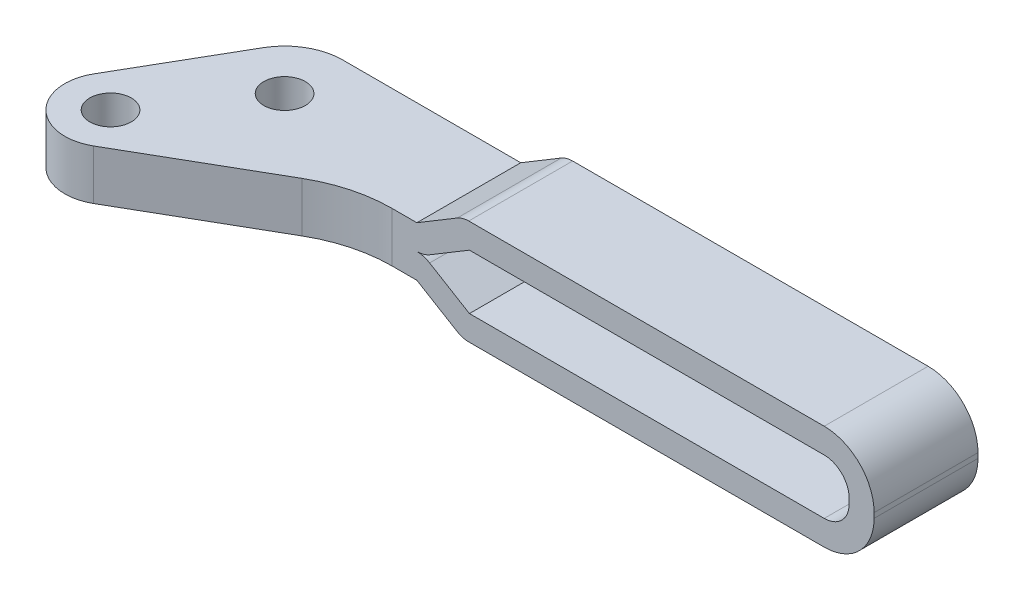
ISO-10303-21;
HEADER;
FILE_DESCRIPTION(('STEP AP214'),'2;1');
FILE_NAME('part.step','',(''),(''),'','','');
FILE_SCHEMA(('AUTOMOTIVE_DESIGN { 1 0 10303 214 1 1 1 1 }'));
ENDSEC;
DATA;
#1=APPLICATION_CONTEXT('core data for automotive mechanical design processes');
#2=APPLICATION_PROTOCOL_DEFINITION('international standard','automotive_design',2000,#1);
#3=PRODUCT_CONTEXT('',#1,'mechanical');
#4=PRODUCT('Part','Part','',(#3));
#5=PRODUCT_RELATED_PRODUCT_CATEGORY('part','',(#4));
#6=PRODUCT_DEFINITION_FORMATION('','',#4);
#7=PRODUCT_DEFINITION_CONTEXT('part definition',#1,'design');
#8=PRODUCT_DEFINITION('design','',#6,#7);
#9=PRODUCT_DEFINITION_SHAPE('','',#8);
#10=(LENGTH_UNIT() NAMED_UNIT(*) SI_UNIT(.MILLI.,.METRE.));
#11=(NAMED_UNIT(*) PLANE_ANGLE_UNIT() SI_UNIT($,.RADIAN.));
#12=(NAMED_UNIT(*) SI_UNIT($,.STERADIAN.) SOLID_ANGLE_UNIT());
#13=UNCERTAINTY_MEASURE_WITH_UNIT(LENGTH_MEASURE(1.E-05),#10,'distance_accuracy_value','');
#14=(GEOMETRIC_REPRESENTATION_CONTEXT(3) GLOBAL_UNCERTAINTY_ASSIGNED_CONTEXT((#13)) GLOBAL_UNIT_ASSIGNED_CONTEXT((#10,
#11,#12)) REPRESENTATION_CONTEXT('',''));
#15=CARTESIAN_POINT('',(0.,0.,0.));
#16=DIRECTION('',(0.,0.,1.));
#17=DIRECTION('',(1.,0.,0.));
#18=AXIS2_PLACEMENT_3D('',#15,#16,#17);
#19=CARTESIAN_POINT('',(30.1762943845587,3.00279999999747,-74.1617743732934));
#20=DIRECTION('',(0.,0.,1.));
#21=DIRECTION('',(1.,0.,0.));
#22=AXIS2_PLACEMENT_3D('',#19,#20,#21);
#23=CYLINDRICAL_SURFACE('',#22,3.);
#24=CARTESIAN_POINT('',(30.1762943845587,3.00279999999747,-6.67526594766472));
#25=DIRECTION('',(0.,0.,1.));
#26=DIRECTION('',(1.,0.,0.));
#27=AXIS2_PLACEMENT_3D('',#24,#25,#26);
#28=CIRCLE('',#27,3.);
#29=CARTESIAN_POINT('',(31.7214086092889,0.431298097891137,-6.67526594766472));
#30=VERTEX_POINT('',#29);
#31=CARTESIAN_POINT('',(30.1716344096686,0.00279819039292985,-6.67526594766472));
#32=VERTEX_POINT('',#31);
#33=EDGE_CURVE('E76',#30,#32,#28,.F.);
#34=ORIENTED_EDGE('',*,*,#33,.T.);
#35=DIRECTION('',(0.,0.,1.));
#36=VECTOR('',#35,1.);
#37=CARTESIAN_POINT('',(30.1716344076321,0.00280361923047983,-12.9252659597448));
#38=LINE('',#37,#36);
#39=CARTESIAN_POINT('',(30.1716344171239,0.00279712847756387,-19.1752659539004));
#40=VERTEX_POINT('',#39);
#41=EDGE_CURVE('E277',#40,#32,#38,.T.);
#42=ORIENTED_EDGE('',*,*,#41,.F.);
#43=CARTESIAN_POINT('',(30.1762943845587,3.00279999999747,-19.1752659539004));
#44=DIRECTION('',(0.,0.,1.));
#45=DIRECTION('',(1.,0.,0.));
#46=AXIS2_PLACEMENT_3D('',#43,#44,#45);
#47=CIRCLE('',#46,3.);
#48=CARTESIAN_POINT('',(31.7214086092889,0.431298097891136,-19.1752659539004));
#49=VERTEX_POINT('',#48);
#50=EDGE_CURVE('E69',#40,#49,#47,.T.);
#51=ORIENTED_EDGE('',*,*,#50,.T.);
#52=DIRECTION('',(0.,0.,1.));
#53=VECTOR('',#52,1.);
#54=CARTESIAN_POINT('',(31.7214086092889,0.431298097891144,-74.1617743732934));
#55=LINE('',#54,#53);
#56=EDGE_CURVE('E295',#49,#30,#55,.T.);
#57=ORIENTED_EDGE('',*,*,#56,.T.);
#58=EDGE_LOOP('',(#34,#42,#51,#57));
#59=FACE_BOUND('',#58,.T.);
#60=ADVANCED_FACE('F14',(#59),#23,.T.);
#61=CARTESIAN_POINT('',(87.8038285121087,6.59999999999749,-6.6752659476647));
#62=DIRECTION('',(0.,0.,1.));
#63=DIRECTION('',(0.,-1.,0.));
#64=AXIS2_PLACEMENT_3D('',#61,#62,#63);
#65=PLANE('',#64);
#66=DIRECTION('',(-0.857167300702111,0.515038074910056,0.));
#67=VECTOR('',#66,1.);
#68=CARTESIAN_POINT('',(36.500390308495,-3.30280000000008,-6.67526594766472));
#69=LINE('',#68,#67);
#70=CARTESIAN_POINT('',(36.500390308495,-3.30280000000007,-6.67526594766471));
#71=VERTEX_POINT('',#70);
#72=CARTESIAN_POINT('',(31.7120886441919,-0.425698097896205,-6.67526594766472));
#73=VERTEX_POINT('',#72);
#74=EDGE_CURVE('E82',#71,#73,#69,.T.);
#75=ORIENTED_EDGE('',*,*,#74,.T.);
#76=CARTESIAN_POINT('',(30.1669744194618,-2.99720000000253,-6.67526594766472));
#77=DIRECTION('',(0.,0.,1.));
#78=DIRECTION('',(1.,0.,0.));
#79=AXIS2_PLACEMENT_3D('',#76,#77,#78);
#80=CIRCLE('',#79,3.);
#81=EDGE_CURVE('E300',#32,#73,#80,.F.);
#82=ORIENTED_EDGE('',*,*,#81,.F.);
#83=ORIENTED_EDGE('',*,*,#33,.F.);
#84=DIRECTION('',(0.857167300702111,0.515038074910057,0.));
#85=VECTOR('',#84,1.);
#86=CARTESIAN_POINT('',(31.7214086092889,0.431298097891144,-6.67526594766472));
#87=LINE('',#86,#85);
#88=CARTESIAN_POINT('',(36.5003903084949,3.30279999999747,-6.67526594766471));
#89=VERTEX_POINT('',#88);
#90=EDGE_CURVE('E467',#30,#89,#87,.T.);
#91=ORIENTED_EDGE('',*,*,#90,.T.);
#92=DIRECTION('',(1.,0.,0.));
#93=VECTOR('',#92,1.);
#94=CARTESIAN_POINT('',(87.8038285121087,3.30279999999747,-6.6752659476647));
#95=LINE('',#94,#93);
#96=CARTESIAN_POINT('',(79.1812007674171,3.30279999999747,-6.67526594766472));
#97=VERTEX_POINT('',#96);
#98=EDGE_CURVE('E464',#89,#97,#95,.T.);
#99=ORIENTED_EDGE('',*,*,#98,.T.);
#100=CARTESIAN_POINT('',(79.1812007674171,0.302799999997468,-6.67526594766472));
#101=DIRECTION('',(0.,0.,1.));
#102=DIRECTION('',(1.,0.,0.));
#103=AXIS2_PLACEMENT_3D('',#100,#101,#102);
#104=CIRCLE('',#103,3.);
#105=CARTESIAN_POINT('',(82.1812007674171,0.302799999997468,-6.67526594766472));
#106=VERTEX_POINT('',#105);
#107=EDGE_CURVE('E466',#97,#106,#104,.F.);
#108=ORIENTED_EDGE('',*,*,#107,.T.);
#109=DIRECTION('',(0.,-1.,0.));
#110=VECTOR('',#109,1.);
#111=CARTESIAN_POINT('',(82.1812007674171,6.59999999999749,-6.6752659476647));
#112=LINE('',#111,#110);
#113=CARTESIAN_POINT('',(82.1812007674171,-0.302800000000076,-6.67526594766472));
#114=VERTEX_POINT('',#113);
#115=EDGE_CURVE('E469',#106,#114,#112,.T.);
#116=ORIENTED_EDGE('',*,*,#115,.T.);
#117=CARTESIAN_POINT('',(79.1812007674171,-0.302800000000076,-6.67526594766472));
#118=DIRECTION('',(0.,0.,1.));
#119=DIRECTION('',(1.,0.,0.));
#120=AXIS2_PLACEMENT_3D('',#117,#118,#119);
#121=CIRCLE('',#120,3.);
#122=CARTESIAN_POINT('',(79.1812007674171,-3.30280000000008,-6.67526594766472));
#123=VERTEX_POINT('',#122);
#124=EDGE_CURVE('E475',#114,#123,#121,.F.);
#125=ORIENTED_EDGE('',*,*,#124,.T.);
#126=DIRECTION('',(1.,0.,0.));
#127=VECTOR('',#126,1.);
#128=CARTESIAN_POINT('',(87.8038285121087,-3.30280000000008,-6.67526594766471));
#129=LINE('',#128,#127);
#130=EDGE_CURVE('E477',#123,#71,#129,.F.);
#131=ORIENTED_EDGE('',*,*,#130,.T.);
#132=EDGE_LOOP('',(#75,#82,#83,#91,#99,#108,#116,#125,#131));
#133=FACE_BOUND('',#132,.T.);
#134=DIRECTION('',(1.,0.,0.));
#135=VECTOR('',#134,1.);
#136=CARTESIAN_POINT('',(87.8038285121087,2.99999999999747,-6.67526594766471));
#137=LINE('',#136,#135);
#138=CARTESIAN_POINT('',(30.177070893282,2.99999999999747,-6.67526594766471));
#139=VERTEX_POINT('',#138);
#140=CARTESIAN_POINT('',(27.1893006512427,2.99999999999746,-6.67526594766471));
#141=VERTEX_POINT('',#140);
#142=EDGE_CURVE('E479',#139,#141,#137,.F.);
#143=ORIENTED_EDGE('',*,*,#142,.T.);
#144=DIRECTION('',(0.,-1.,0.));
#145=VECTOR('',#144,1.);
#146=CARTESIAN_POINT('',(27.1893006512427,6.59999999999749,-6.67526594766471));
#147=LINE('',#146,#145);
#148=CARTESIAN_POINT('',(27.1893006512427,-3.00000000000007,-6.67526594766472));
#149=VERTEX_POINT('',#148);
#150=EDGE_CURVE('E481',#141,#149,#147,.T.);
#151=ORIENTED_EDGE('',*,*,#150,.T.);
#152=DIRECTION('',(1.,0.,0.));
#153=VECTOR('',#152,1.);
#154=CARTESIAN_POINT('',(87.8038285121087,-3.00000000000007,-6.67526594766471));
#155=LINE('',#154,#153);
#156=CARTESIAN_POINT('',(30.1770708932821,-3.00000000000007,-6.67526594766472));
#157=VERTEX_POINT('',#156);
#158=EDGE_CURVE('E483',#149,#157,#155,.T.);
#159=ORIENTED_EDGE('',*,*,#158,.T.);
#160=DIRECTION('',(0.857167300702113,-0.515038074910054,0.));
#161=VECTOR('',#160,1.);
#162=CARTESIAN_POINT('',(30.1770708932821,-3.00000000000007,-6.67526594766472));
#163=LINE('',#162,#161);
#164=CARTESIAN_POINT('',(35.0280322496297,-5.91475164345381,-6.67526594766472));
#165=VERTEX_POINT('',#164);
#166=EDGE_CURVE('E446',#157,#165,#163,.T.);
#167=ORIENTED_EDGE('',*,*,#166,.T.);
#168=CARTESIAN_POINT('',(36.4171929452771,-3.60280000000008,-6.67526594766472));
#169=DIRECTION('',(0.,0.,1.));
#170=DIRECTION('',(1.,0.,0.));
#171=AXIS2_PLACEMENT_3D('',#168,#169,#170);
#172=CIRCLE('',#171,2.6972);
#173=CARTESIAN_POINT('',(36.4171929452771,-6.30000000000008,-6.67526594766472));
#174=VERTEX_POINT('',#173);
#175=EDGE_CURVE('E443',#165,#174,#172,.T.);
#176=ORIENTED_EDGE('',*,*,#175,.T.);
#177=DIRECTION('',(1.,0.,0.));
#178=VECTOR('',#177,1.);
#179=CARTESIAN_POINT('',(87.8038285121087,-6.30000000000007,-6.67526594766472));
#180=LINE('',#179,#178);
#181=CARTESIAN_POINT('',(79.1812007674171,-6.30000000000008,-6.67526594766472));
#182=VERTEX_POINT('',#181);
#183=EDGE_CURVE('E441',#174,#182,#180,.T.);
#184=ORIENTED_EDGE('',*,*,#183,.T.);
#185=CARTESIAN_POINT('',(79.1812007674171,-0.30000000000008,-6.67526594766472));
#186=DIRECTION('',(0.,0.,1.));
#187=DIRECTION('',(1.,0.,0.));
#188=AXIS2_PLACEMENT_3D('',#185,#186,#187);
#189=CIRCLE('',#188,6.);
#190=CARTESIAN_POINT('',(85.1812007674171,-0.30000000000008,-6.67526594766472));
#191=VERTEX_POINT('',#190);
#192=EDGE_CURVE('E429',#191,#182,#189,.F.);
#193=ORIENTED_EDGE('',*,*,#192,.F.);
#194=DIRECTION('',(0.,-1.,0.));
#195=VECTOR('',#194,1.);
#196=CARTESIAN_POINT('',(85.1812007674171,6.59999999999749,-6.6752659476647));
#197=LINE('',#196,#195);
#198=CARTESIAN_POINT('',(85.1812007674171,0.299999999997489,-6.67526594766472));
#199=VERTEX_POINT('',#198);
#200=EDGE_CURVE('E425',#191,#199,#197,.F.);
#201=ORIENTED_EDGE('',*,*,#200,.T.);
#202=CARTESIAN_POINT('',(79.1812007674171,0.299999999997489,-6.67526594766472));
#203=DIRECTION('',(0.,0.,1.));
#204=DIRECTION('',(1.,0.,0.));
#205=AXIS2_PLACEMENT_3D('',#202,#203,#204);
#206=CIRCLE('',#205,6.);
#207=CARTESIAN_POINT('',(79.1812007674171,6.29999999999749,-6.67526594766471));
#208=VERTEX_POINT('',#207);
#209=EDGE_CURVE('E418',#199,#208,#206,.T.);
#210=ORIENTED_EDGE('',*,*,#209,.T.);
#211=DIRECTION('',(1.,0.,0.));
#212=VECTOR('',#211,1.);
#213=CARTESIAN_POINT('',(87.8038285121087,6.29999999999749,-6.6752659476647));
#214=LINE('',#213,#212);
#215=CARTESIAN_POINT('',(36.4171929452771,6.29999999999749,-6.67526594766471));
#216=VERTEX_POINT('',#215);
#217=EDGE_CURVE('E293',#208,#216,#214,.F.);
#218=ORIENTED_EDGE('',*,*,#217,.T.);
#219=CARTESIAN_POINT('',(36.4171929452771,3.60279999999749,-6.67526594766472));
#220=DIRECTION('',(0.,0.,1.));
#221=DIRECTION('',(1.,0.,0.));
#222=AXIS2_PLACEMENT_3D('',#219,#220,#221);
#223=CIRCLE('',#222,2.6972);
#224=CARTESIAN_POINT('',(35.0280322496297,5.91475164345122,-6.67526594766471));
#225=VERTEX_POINT('',#224);
#226=EDGE_CURVE('E289',#225,#216,#223,.F.);
#227=ORIENTED_EDGE('',*,*,#226,.F.);
#228=DIRECTION('',(-0.857167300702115,-0.51503807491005,0.));
#229=VECTOR('',#228,1.);
#230=CARTESIAN_POINT('',(35.0280322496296,5.9147516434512,-6.67526594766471));
#231=LINE('',#230,#229);
#232=EDGE_CURVE('E292',#225,#139,#231,.T.);
#233=ORIENTED_EDGE('',*,*,#232,.T.);
#234=EDGE_LOOP('',(#143,#151,#159,#167,#176,#184,#193,#201,#210,#218,#227,#233));
#235=FACE_BOUND('',#234,.T.);
#236=ADVANCED_FACE('F485',(#133,#235),#65,.T.);
#237=CARTESIAN_POINT('',(30.1669744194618,-2.99720000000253,-74.1617743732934));
#238=DIRECTION('',(0.,0.,1.));
#239=DIRECTION('',(1.,0.,0.));
#240=AXIS2_PLACEMENT_3D('',#237,#238,#239);
#241=CYLINDRICAL_SURFACE('',#240,3.);
#242=ORIENTED_EDGE('',*,*,#81,.T.);
#243=DIRECTION('',(0.,0.,1.));
#244=VECTOR('',#243,1.);
#245=CARTESIAN_POINT('',(31.7120886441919,-0.425698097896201,-74.1617743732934));
#246=LINE('',#245,#244);
#247=CARTESIAN_POINT('',(31.7120886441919,-0.425698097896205,-19.1752659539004));
#248=VERTEX_POINT('',#247);
#249=EDGE_CURVE('E286',#73,#248,#246,.F.);
#250=ORIENTED_EDGE('',*,*,#249,.T.);
#251=CARTESIAN_POINT('',(30.1669744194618,-2.99720000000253,-19.1752659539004));
#252=DIRECTION('',(0.,0.,1.));
#253=DIRECTION('',(1.,0.,0.));
#254=AXIS2_PLACEMENT_3D('',#251,#252,#253);
#255=CIRCLE('',#254,3.);
#256=EDGE_CURVE('E281',#248,#40,#255,.T.);
#257=ORIENTED_EDGE('',*,*,#256,.T.);
#258=ORIENTED_EDGE('',*,*,#41,.T.);
#259=EDGE_LOOP('',(#242,#250,#257,#258));
#260=FACE_BOUND('',#259,.T.);
#261=ADVANCED_FACE('F299',(#260),#241,.T.);
#262=CARTESIAN_POINT('',(7.8038285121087,6.59999999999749,-19.1752659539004));
#263=DIRECTION('',(0.,0.,-1.));
#264=DIRECTION('',(0.,1.,0.));
#265=AXIS2_PLACEMENT_3D('',#262,#263,#264);
#266=PLANE('',#265);
#267=CARTESIAN_POINT('',(79.1812007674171,0.302799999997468,-19.1752659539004));
#268=DIRECTION('',(0.,0.,1.));
#269=DIRECTION('',(1.,0.,0.));
#270=AXIS2_PLACEMENT_3D('',#267,#268,#269);
#271=CIRCLE('',#270,3.);
#272=CARTESIAN_POINT('',(82.1812007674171,0.302799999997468,-19.1752659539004));
#273=VERTEX_POINT('',#272);
#274=CARTESIAN_POINT('',(79.1812007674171,3.30279999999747,-19.1752659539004));
#275=VERTEX_POINT('',#274);
#276=EDGE_CURVE('E280',#273,#275,#271,.T.);
#277=ORIENTED_EDGE('',*,*,#276,.T.);
#278=DIRECTION('',(1.,0.,0.));
#279=VECTOR('',#278,1.);
#280=CARTESIAN_POINT('',(7.8038285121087,3.30279999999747,-19.1752659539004));
#281=LINE('',#280,#279);
#282=CARTESIAN_POINT('',(36.5003903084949,3.30279999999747,-19.1752659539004));
#283=VERTEX_POINT('',#282);
#284=EDGE_CURVE('E320',#275,#283,#281,.F.);
#285=ORIENTED_EDGE('',*,*,#284,.T.);
#286=DIRECTION('',(-0.857167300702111,-0.515038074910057,0.));
#287=VECTOR('',#286,1.);
#288=CARTESIAN_POINT('',(36.5003903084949,3.30279999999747,-19.1752659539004));
#289=LINE('',#288,#287);
#290=EDGE_CURVE('E316',#283,#49,#289,.T.);
#291=ORIENTED_EDGE('',*,*,#290,.T.);
#292=ORIENTED_EDGE('',*,*,#50,.F.);
#293=ORIENTED_EDGE('',*,*,#256,.F.);
#294=DIRECTION('',(0.857167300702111,-0.515038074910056,0.));
#295=VECTOR('',#294,1.);
#296=CARTESIAN_POINT('',(31.7120886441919,-0.425698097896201,-19.1752659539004));
#297=LINE('',#296,#295);
#298=CARTESIAN_POINT('',(36.500390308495,-3.30280000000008,-19.1752659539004));
#299=VERTEX_POINT('',#298);
#300=EDGE_CURVE('E307',#248,#299,#297,.T.);
#301=ORIENTED_EDGE('',*,*,#300,.T.);
#302=DIRECTION('',(1.,0.,0.));
#303=VECTOR('',#302,1.);
#304=CARTESIAN_POINT('',(7.8038285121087,-3.30280000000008,-19.1752659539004));
#305=LINE('',#304,#303);
#306=CARTESIAN_POINT('',(79.1812007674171,-3.30280000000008,-19.1752659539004));
#307=VERTEX_POINT('',#306);
#308=EDGE_CURVE('E315',#299,#307,#305,.T.);
#309=ORIENTED_EDGE('',*,*,#308,.T.);
#310=CARTESIAN_POINT('',(79.1812007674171,-0.302800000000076,-19.1752659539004));
#311=DIRECTION('',(0.,0.,1.));
#312=DIRECTION('',(1.,0.,0.));
#313=AXIS2_PLACEMENT_3D('',#310,#311,#312);
#314=CIRCLE('',#313,3.);
#315=CARTESIAN_POINT('',(82.1812007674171,-0.302800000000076,-19.1752659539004));
#316=VERTEX_POINT('',#315);
#317=EDGE_CURVE('E318',#307,#316,#314,.T.);
#318=ORIENTED_EDGE('',*,*,#317,.T.);
#319=DIRECTION('',(0.,1.,0.));
#320=VECTOR('',#319,1.);
#321=CARTESIAN_POINT('',(82.1812007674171,6.59999999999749,-19.1752659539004));
#322=LINE('',#321,#320);
#323=EDGE_CURVE('E325',#316,#273,#322,.T.);
#324=ORIENTED_EDGE('',*,*,#323,.T.);
#325=EDGE_LOOP('',(#277,#285,#291,#292,#293,#301,#309,#318,#324));
#326=FACE_BOUND('',#325,.T.);
#327=DIRECTION('',(1.,0.,0.));
#328=VECTOR('',#327,1.);
#329=CARTESIAN_POINT('',(7.8038285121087,-6.30000000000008,-19.1752659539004));
#330=LINE('',#329,#328);
#331=CARTESIAN_POINT('',(79.1812007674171,-6.30000000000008,-19.1752659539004));
#332=VERTEX_POINT('',#331);
#333=CARTESIAN_POINT('',(36.4171929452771,-6.30000000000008,-19.1752659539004));
#334=VERTEX_POINT('',#333);
#335=EDGE_CURVE('E328',#332,#334,#330,.F.);
#336=ORIENTED_EDGE('',*,*,#335,.T.);
#337=CARTESIAN_POINT('',(36.4171929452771,-3.60280000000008,-19.1752659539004));
#338=DIRECTION('',(0.,0.,1.));
#339=DIRECTION('',(1.,0.,0.));
#340=AXIS2_PLACEMENT_3D('',#337,#338,#339);
#341=CIRCLE('',#340,2.6972);
#342=CARTESIAN_POINT('',(35.0280322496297,-5.91475164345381,-19.1752659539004));
#343=VERTEX_POINT('',#342);
#344=EDGE_CURVE('E330',#334,#343,#341,.F.);
#345=ORIENTED_EDGE('',*,*,#344,.T.);
#346=DIRECTION('',(-0.857167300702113,0.515038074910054,0.));
#347=VECTOR('',#346,1.);
#348=CARTESIAN_POINT('',(35.0280322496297,-5.9147516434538,-19.1752659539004));
#349=LINE('',#348,#347);
#350=CARTESIAN_POINT('',(30.1770708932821,-3.00000000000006,-19.1752659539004));
#351=VERTEX_POINT('',#350);
#352=EDGE_CURVE('E332',#343,#351,#349,.T.);
#353=ORIENTED_EDGE('',*,*,#352,.T.);
#354=DIRECTION('',(1.,0.,0.));
#355=VECTOR('',#354,1.);
#356=CARTESIAN_POINT('',(7.8038285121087,-3.00000000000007,-19.1752659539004));
#357=LINE('',#356,#355);
#358=CARTESIAN_POINT('',(8.76144388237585,-3.00000000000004,-19.1752659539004));
#359=VERTEX_POINT('',#358);
#360=EDGE_CURVE('E334',#351,#359,#357,.F.);
#361=ORIENTED_EDGE('',*,*,#360,.T.);
#362=DIRECTION('',(0.,1.,0.));
#363=VECTOR('',#362,1.);
#364=CARTESIAN_POINT('',(8.7614438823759,6.59999999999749,-19.1752659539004));
#365=LINE('',#364,#363);
#366=CARTESIAN_POINT('',(8.76144388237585,2.99999999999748,-19.1752659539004));
#367=VERTEX_POINT('',#366);
#368=EDGE_CURVE('E336',#359,#367,#365,.T.);
#369=ORIENTED_EDGE('',*,*,#368,.T.);
#370=DIRECTION('',(1.,0.,0.));
#371=VECTOR('',#370,1.);
#372=CARTESIAN_POINT('',(7.8038285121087,2.99999999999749,-19.1752659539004));
#373=LINE('',#372,#371);
#374=CARTESIAN_POINT('',(30.177070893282,2.99999999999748,-19.1752659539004));
#375=VERTEX_POINT('',#374);
#376=EDGE_CURVE('E338',#367,#375,#373,.T.);
#377=ORIENTED_EDGE('',*,*,#376,.T.);
#378=DIRECTION('',(0.857167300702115,0.51503807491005,0.));
#379=VECTOR('',#378,1.);
#380=CARTESIAN_POINT('',(30.177070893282,2.99999999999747,-19.1752659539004));
#381=LINE('',#380,#379);
#382=CARTESIAN_POINT('',(35.0280322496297,5.91475164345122,-19.1752659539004));
#383=VERTEX_POINT('',#382);
#384=EDGE_CURVE('E276',#375,#383,#381,.T.);
#385=ORIENTED_EDGE('',*,*,#384,.T.);
#386=CARTESIAN_POINT('',(36.4171929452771,3.60279999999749,-19.1752659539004));
#387=DIRECTION('',(0.,0.,1.));
#388=DIRECTION('',(1.,0.,0.));
#389=AXIS2_PLACEMENT_3D('',#386,#387,#388);
#390=CIRCLE('',#389,2.6972);
#391=CARTESIAN_POINT('',(36.4171929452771,6.29999999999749,-19.1752659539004));
#392=VERTEX_POINT('',#391);
#393=EDGE_CURVE('E272',#392,#383,#390,.T.);
#394=ORIENTED_EDGE('',*,*,#393,.F.);
#395=DIRECTION('',(1.,0.,0.));
#396=VECTOR('',#395,1.);
#397=CARTESIAN_POINT('',(7.8038285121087,6.29999999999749,-19.1752659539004));
#398=LINE('',#397,#396);
#399=CARTESIAN_POINT('',(79.1812007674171,6.29999999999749,-19.1752659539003));
#400=VERTEX_POINT('',#399);
#401=EDGE_CURVE('E275',#392,#400,#398,.T.);
#402=ORIENTED_EDGE('',*,*,#401,.T.);
#403=CARTESIAN_POINT('',(79.1812007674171,0.299999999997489,-19.1752659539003));
#404=DIRECTION('',(0.,0.,1.));
#405=DIRECTION('',(1.,0.,0.));
#406=AXIS2_PLACEMENT_3D('',#403,#404,#405);
#407=CIRCLE('',#406,6.);
#408=CARTESIAN_POINT('',(85.1812007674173,0.299999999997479,-19.1752659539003));
#409=VERTEX_POINT('',#408);
#410=EDGE_CURVE('E342',#400,#409,#407,.F.);
#411=ORIENTED_EDGE('',*,*,#410,.T.);
#412=DIRECTION('',(0.,1.,0.));
#413=VECTOR('',#412,1.);
#414=CARTESIAN_POINT('',(85.1812007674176,61.0509586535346,-19.1752659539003));
#415=LINE('',#414,#413);
#416=CARTESIAN_POINT('',(85.1812007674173,-0.30000000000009,-19.1752659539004));
#417=VERTEX_POINT('',#416);
#418=EDGE_CURVE('E344',#417,#409,#415,.T.);
#419=ORIENTED_EDGE('',*,*,#418,.F.);
#420=CARTESIAN_POINT('',(79.1812007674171,-0.30000000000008,-19.1752659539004));
#421=DIRECTION('',(0.,0.,1.));
#422=DIRECTION('',(1.,0.,0.));
#423=AXIS2_PLACEMENT_3D('',#420,#421,#422);
#424=CIRCLE('',#423,6.);
#425=EDGE_CURVE('E347',#417,#332,#424,.F.);
#426=ORIENTED_EDGE('',*,*,#425,.T.);
#427=EDGE_LOOP('',(#336,#345,#353,#361,#369,#377,#385,#394,#402,#411,#419,#426));
#428=FACE_BOUND('',#427,.T.);
#429=ADVANCED_FACE('F305',(#326,#428),#266,.T.);
#430=CARTESIAN_POINT('',(36.5003903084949,3.30279999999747,-74.1617743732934));
#431=DIRECTION('',(-0.515038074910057,0.857167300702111,0.));
#432=DIRECTION('',(-0.857167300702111,-0.515038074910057,0.));
#433=AXIS2_PLACEMENT_3D('',#430,#431,#432);
#434=PLANE('',#433);
#435=DIRECTION('',(0.,0.,1.));
#436=VECTOR('',#435,1.);
#437=CARTESIAN_POINT('',(36.5003903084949,3.30279999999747,-74.1617743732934));
#438=LINE('',#437,#436);
#439=EDGE_CURVE('E350',#283,#89,#438,.T.);
#440=ORIENTED_EDGE('',*,*,#439,.T.);
#441=ORIENTED_EDGE('',*,*,#90,.F.);
#442=ORIENTED_EDGE('',*,*,#56,.F.);
#443=ORIENTED_EDGE('',*,*,#290,.F.);
#444=EDGE_LOOP('',(#440,#441,#442,#443));
#445=FACE_BOUND('',#444,.T.);
#446=ADVANCED_FACE('F461',(#445),#434,.F.);
#447=CARTESIAN_POINT('',(31.7120886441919,-0.425698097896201,-74.1617743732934));
#448=DIRECTION('',(-0.515038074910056,-0.857167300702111,0.));
#449=DIRECTION('',(0.857167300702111,-0.515038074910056,0.));
#450=AXIS2_PLACEMENT_3D('',#447,#448,#449);
#451=PLANE('',#450);
#452=ORIENTED_EDGE('',*,*,#249,.F.);
#453=ORIENTED_EDGE('',*,*,#74,.F.);
#454=DIRECTION('',(0.,0.,-1.));
#455=VECTOR('',#454,1.);
#456=CARTESIAN_POINT('',(36.500390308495,-3.30280000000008,-74.1617743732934));
#457=LINE('',#456,#455);
#458=EDGE_CURVE('E314',#71,#299,#457,.T.);
#459=ORIENTED_EDGE('',*,*,#458,.T.);
#460=ORIENTED_EDGE('',*,*,#300,.F.);
#461=EDGE_LOOP('',(#452,#453,#459,#460));
#462=FACE_BOUND('',#461,.T.);
#463=ADVANCED_FACE('F312',(#462),#451,.F.);
#464=CARTESIAN_POINT('',(79.1812007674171,3.30279999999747,-74.1617743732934));
#465=DIRECTION('',(0.,1.,0.));
#466=DIRECTION('',(-1.,0.,0.));
#467=AXIS2_PLACEMENT_3D('',#464,#465,#466);
#468=PLANE('',#467);
#469=DIRECTION('',(0.,0.,1.));
#470=VECTOR('',#469,1.);
#471=CARTESIAN_POINT('',(79.1812007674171,3.30279999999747,-74.1617743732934));
#472=LINE('',#471,#470);
#473=EDGE_CURVE('E354',#97,#275,#472,.F.);
#474=ORIENTED_EDGE('',*,*,#473,.F.);
#475=ORIENTED_EDGE('',*,*,#98,.F.);
#476=ORIENTED_EDGE('',*,*,#439,.F.);
#477=ORIENTED_EDGE('',*,*,#284,.F.);
#478=EDGE_LOOP('',(#474,#475,#476,#477));
#479=FACE_BOUND('',#478,.T.);
#480=ADVANCED_FACE('F463',(#479),#468,.F.);
#481=CARTESIAN_POINT('',(79.1812007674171,0.302799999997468,-74.1617743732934));
#482=DIRECTION('',(0.,0.,1.));
#483=DIRECTION('',(1.,0.,0.));
#484=AXIS2_PLACEMENT_3D('',#481,#482,#483);
#485=CYLINDRICAL_SURFACE('',#484,3.);
#486=DIRECTION('',(0.,0.,1.));
#487=VECTOR('',#486,1.);
#488=CARTESIAN_POINT('',(82.1812007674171,0.302799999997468,-74.1617743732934));
#489=LINE('',#488,#487);
#490=EDGE_CURVE('E357',#106,#273,#489,.F.);
#491=ORIENTED_EDGE('',*,*,#490,.F.);
#492=ORIENTED_EDGE('',*,*,#107,.F.);
#493=ORIENTED_EDGE('',*,*,#473,.T.);
#494=ORIENTED_EDGE('',*,*,#276,.F.);
#495=EDGE_LOOP('',(#491,#492,#493,#494));
#496=FACE_BOUND('',#495,.T.);
#497=ADVANCED_FACE('F630',(#496),#485,.F.);
#498=CARTESIAN_POINT('',(82.1812007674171,0.302799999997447,-74.1617743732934));
#499=DIRECTION('',(1.,0.,0.));
#500=DIRECTION('',(0.,0.,-1.));
#501=AXIS2_PLACEMENT_3D('',#498,#499,#500);
#502=PLANE('',#501);
#503=DIRECTION('',(0.,0.,1.));
#504=VECTOR('',#503,1.);
#505=CARTESIAN_POINT('',(82.1812007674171,-0.302800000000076,-74.1617743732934));
#506=LINE('',#505,#504);
#507=EDGE_CURVE('E360',#316,#114,#506,.T.);
#508=ORIENTED_EDGE('',*,*,#507,.T.);
#509=ORIENTED_EDGE('',*,*,#115,.F.);
#510=ORIENTED_EDGE('',*,*,#490,.T.);
#511=ORIENTED_EDGE('',*,*,#323,.F.);
#512=EDGE_LOOP('',(#508,#509,#510,#511));
#513=FACE_BOUND('',#512,.T.);
#514=ADVANCED_FACE('F622',(#513),#502,.F.);
#515=CARTESIAN_POINT('',(79.1812007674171,-0.302800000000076,-74.1617743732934));
#516=DIRECTION('',(0.,0.,1.));
#517=DIRECTION('',(1.,0.,0.));
#518=AXIS2_PLACEMENT_3D('',#515,#516,#517);
#519=CYLINDRICAL_SURFACE('',#518,3.);
#520=DIRECTION('',(0.,0.,1.));
#521=VECTOR('',#520,1.);
#522=CARTESIAN_POINT('',(79.1812007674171,-3.30280000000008,-74.1617743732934));
#523=LINE('',#522,#521);
#524=EDGE_CURVE('E363',#123,#307,#523,.F.);
#525=ORIENTED_EDGE('',*,*,#524,.F.);
#526=ORIENTED_EDGE('',*,*,#124,.F.);
#527=ORIENTED_EDGE('',*,*,#507,.F.);
#528=ORIENTED_EDGE('',*,*,#317,.F.);
#529=EDGE_LOOP('',(#525,#526,#527,#528));
#530=FACE_BOUND('',#529,.T.);
#531=ADVANCED_FACE('F615',(#530),#519,.F.);
#532=CARTESIAN_POINT('',(36.500390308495,-3.30280000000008,-74.1617743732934));
#533=DIRECTION('',(0.,-1.,0.));
#534=DIRECTION('',(0.,0.,-1.));
#535=AXIS2_PLACEMENT_3D('',#532,#533,#534);
#536=PLANE('',#535);
#537=ORIENTED_EDGE('',*,*,#458,.F.);
#538=ORIENTED_EDGE('',*,*,#130,.F.);
#539=ORIENTED_EDGE('',*,*,#524,.T.);
#540=ORIENTED_EDGE('',*,*,#308,.F.);
#541=EDGE_LOOP('',(#537,#538,#539,#540));
#542=FACE_BOUND('',#541,.T.);
#543=ADVANCED_FACE('F500',(#542),#536,.F.);
#544=CARTESIAN_POINT('',(26.7598418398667,2.99999999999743,11.4222076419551));
#545=DIRECTION('',(0.,1.,0.));
#546=DIRECTION('',(0.,0.,1.));
#547=AXIS2_PLACEMENT_3D('',#544,#545,#546);
#548=PLANE('',#547);
#549=CARTESIAN_POINT('',(8.7614438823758,2.99999999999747,-12.1752659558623));
#550=DIRECTION('',(0.,-1.,0.));
#551=DIRECTION('',(0.,0.,-1.));
#552=AXIS2_PLACEMENT_3D('',#549,#550,#551);
#553=CIRCLE('',#552,2.5);
#554=CARTESIAN_POINT('',(8.7614438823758,2.99999999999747,-14.6752659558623));
#555=VERTEX_POINT('',#554);
#556=EDGE_CURVE('E366',#555,#555,#553,.T.);
#557=ORIENTED_EDGE('',*,*,#556,.T.);
#558=EDGE_LOOP('',(#557));
#559=FACE_BOUND('',#558,.T.);
#560=CARTESIAN_POINT('',(0.,2.99999999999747,0.));
#561=DIRECTION('',(0.,-1.,0.));
#562=DIRECTION('',(0.,0.,-1.));
#563=AXIS2_PLACEMENT_3D('',#560,#561,#562);
#564=CIRCLE('',#563,2.5);
#565=CARTESIAN_POINT('',(0.,2.99999999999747,-2.5));
#566=VERTEX_POINT('',#565);
#567=EDGE_CURVE('E220',#566,#566,#564,.T.);
#568=ORIENTED_EDGE('',*,*,#567,.T.);
#569=EDGE_LOOP('',(#568));
#570=FACE_BOUND('',#569,.T.);
#571=CARTESIAN_POINT('',(0.,2.99999999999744,0.));
#572=DIRECTION('',(0.,-1.,0.));
#573=DIRECTION('',(0.,0.,-1.));
#574=AXIS2_PLACEMENT_3D('',#571,#572,#573);
#575=CIRCLE('',#574,5.5);
#576=CARTESIAN_POINT('',(-4.7631397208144,2.99999999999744,-2.75));
#577=VERTEX_POINT('',#576);
#578=CARTESIAN_POINT('',(2.74395404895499,2.99999999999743,4.76662523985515));
#579=VERTEX_POINT('',#578);
#580=EDGE_CURVE('E216',#577,#579,#575,.F.);
#581=ORIENTED_EDGE('',*,*,#580,.T.);
#582=DIRECTION('',(0.866659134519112,0.,-0.498900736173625));
#583=VECTOR('',#582,1.);
#584=CARTESIAN_POINT('',(2.743954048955,2.99999999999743,4.76662523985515));
#585=LINE('',#584,#583);
#586=CARTESIAN_POINT('',(18.660144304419,2.99999999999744,-4.39568404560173));
#587=VERTEX_POINT('',#586);
#588=EDGE_CURVE('E210',#579,#587,#585,.T.);
#589=ORIENTED_EDGE('',*,*,#588,.T.);
#590=CARTESIAN_POINT('',(27.1893006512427,2.99999999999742,10.4206325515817));
#591=DIRECTION('',(0.,-1.,0.));
#592=DIRECTION('',(0.,0.,-1.));
#593=AXIS2_PLACEMENT_3D('',#590,#591,#592);
#594=CIRCLE('',#593,17.0958984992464);
#595=EDGE_CURVE('E215',#587,#141,#594,.T.);
#596=ORIENTED_EDGE('',*,*,#595,.T.);
#597=ORIENTED_EDGE('',*,*,#142,.F.);
#598=DIRECTION('',(0.,0.,1.));
#599=VECTOR('',#598,1.);
#600=CARTESIAN_POINT('',(30.177070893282,2.99999999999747,-19.175369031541));
#601=LINE('',#600,#599);
#602=EDGE_CURVE('E218',#139,#375,#601,.F.);
#603=ORIENTED_EDGE('',*,*,#602,.T.);
#604=ORIENTED_EDGE('',*,*,#376,.F.);
#605=CARTESIAN_POINT('',(8.7614438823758,2.99999999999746,-12.1752659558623));
#606=DIRECTION('',(0.,-1.,0.));
#607=DIRECTION('',(0.,0.,-1.));
#608=AXIS2_PLACEMENT_3D('',#605,#606,#607);
#609=CIRCLE('',#608,6.9999999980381);
#610=CARTESIAN_POINT('',(2.69926605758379,2.99999999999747,-15.6752659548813));
#611=VERTEX_POINT('',#610);
#612=EDGE_CURVE('E226',#367,#611,#609,.F.);
#613=ORIENTED_EDGE('',*,*,#612,.T.);
#614=DIRECTION('',(-0.5,0.,0.866025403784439));
#615=VECTOR('',#614,1.);
#616=CARTESIAN_POINT('',(2.6992660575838,2.99999999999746,-15.6752659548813));
#617=LINE('',#616,#615);
#618=EDGE_CURVE('E228',#611,#577,#617,.T.);
#619=ORIENTED_EDGE('',*,*,#618,.T.);
#620=EDGE_LOOP('',(#581,#589,#596,#597,#603,#604,#613,#619));
#621=FACE_BOUND('',#620,.T.);
#622=ADVANCED_FACE('F371',(#559,#570,#621),#548,.T.);
#623=CARTESIAN_POINT('',(27.1893006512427,-0.00280000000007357,10.4206325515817));
#624=DIRECTION('',(0.,-1.,0.));
#625=DIRECTION('',(0.,0.,-1.));
#626=AXIS2_PLACEMENT_3D('',#623,#624,#625);
#627=CYLINDRICAL_SURFACE('',#626,17.0958984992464);
#628=ORIENTED_EDGE('',*,*,#595,.F.);
#629=DIRECTION('',(0.,-1.,0.));
#630=VECTOR('',#629,1.);
#631=CARTESIAN_POINT('',(18.660144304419,-0.00280000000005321,-4.39568404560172));
#632=LINE('',#631,#630);
#633=CARTESIAN_POINT('',(18.660144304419,-3.00000000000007,-4.39568404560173));
#634=VERTEX_POINT('',#633);
#635=EDGE_CURVE('E211',#634,#587,#632,.F.);
#636=ORIENTED_EDGE('',*,*,#635,.F.);
#637=CARTESIAN_POINT('',(27.1893006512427,-3.00000000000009,10.4206325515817));
#638=DIRECTION('',(0.,-1.,0.));
#639=DIRECTION('',(0.,0.,-1.));
#640=AXIS2_PLACEMENT_3D('',#637,#638,#639);
#641=CIRCLE('',#640,17.0958984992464);
#642=EDGE_CURVE('E197',#634,#149,#641,.T.);
#643=ORIENTED_EDGE('',*,*,#642,.T.);
#644=ORIENTED_EDGE('',*,*,#150,.F.);
#645=EDGE_LOOP('',(#628,#636,#643,#644));
#646=FACE_BOUND('',#645,.T.);
#647=ADVANCED_FACE('F491',(#646),#627,.F.);
#648=CARTESIAN_POINT('',(27.1893006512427,-3.00000000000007,10.4206325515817));
#649=DIRECTION('',(0.,1.,0.));
#650=DIRECTION('',(0.,0.,1.));
#651=AXIS2_PLACEMENT_3D('',#648,#649,#650);
#652=PLANE('',#651);
#653=ORIENTED_EDGE('',*,*,#642,.F.);
#654=DIRECTION('',(0.866659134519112,0.,-0.498900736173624));
#655=VECTOR('',#654,1.);
#656=CARTESIAN_POINT('',(2.743954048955,-3.00000000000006,4.76662523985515));
#657=LINE('',#656,#655);
#658=CARTESIAN_POINT('',(2.74395404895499,-3.00000000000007,4.76662523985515));
#659=VERTEX_POINT('',#658);
#660=EDGE_CURVE('E190',#659,#634,#657,.T.);
#661=ORIENTED_EDGE('',*,*,#660,.F.);
#662=CARTESIAN_POINT('',(0.,-3.00000000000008,0.));
#663=DIRECTION('',(0.,-1.,0.));
#664=DIRECTION('',(0.,0.,-1.));
#665=AXIS2_PLACEMENT_3D('',#662,#663,#664);
#666=CIRCLE('',#665,5.5);
#667=CARTESIAN_POINT('',(-4.76313972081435,-3.00000000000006,-2.74999999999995));
#668=VERTEX_POINT('',#667);
#669=EDGE_CURVE('E194',#668,#659,#666,.F.);
#670=ORIENTED_EDGE('',*,*,#669,.F.);
#671=DIRECTION('',(-0.5,0.,0.866025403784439));
#672=VECTOR('',#671,1.);
#673=CARTESIAN_POINT('',(2.6992660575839,-3.,-15.6752659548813));
#674=LINE('',#673,#672);
#675=CARTESIAN_POINT('',(2.69926605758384,-3.,-15.6752659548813));
#676=VERTEX_POINT('',#675);
#677=EDGE_CURVE('E33',#676,#668,#674,.T.);
#678=ORIENTED_EDGE('',*,*,#677,.F.);
#679=CARTESIAN_POINT('',(8.7614438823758,-3.,-12.1752659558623));
#680=DIRECTION('',(0.,-1.,0.));
#681=DIRECTION('',(0.,0.,-1.));
#682=AXIS2_PLACEMENT_3D('',#679,#680,#681);
#683=CIRCLE('',#682,6.9999999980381);
#684=EDGE_CURVE('E234',#359,#676,#683,.F.);
#685=ORIENTED_EDGE('',*,*,#684,.F.);
#686=ORIENTED_EDGE('',*,*,#360,.F.);
#687=DIRECTION('',(0.,0.,1.));
#688=VECTOR('',#687,1.);
#689=CARTESIAN_POINT('',(30.1770708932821,-3.00000000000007,10.4206325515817));
#690=LINE('',#689,#688);
#691=EDGE_CURVE('E236',#157,#351,#690,.F.);
#692=ORIENTED_EDGE('',*,*,#691,.F.);
#693=ORIENTED_EDGE('',*,*,#158,.F.);
#694=EDGE_LOOP('',(#653,#661,#670,#678,#685,#686,#692,#693));
#695=FACE_BOUND('',#694,.T.);
#696=CARTESIAN_POINT('',(8.7614438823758,-3.,-12.1752659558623));
#697=DIRECTION('',(0.,-1.,0.));
#698=DIRECTION('',(0.,0.,-1.));
#699=AXIS2_PLACEMENT_3D('',#696,#697,#698);
#700=CIRCLE('',#699,2.5);
#701=CARTESIAN_POINT('',(8.7614438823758,-3.,-14.6752659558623));
#702=VERTEX_POINT('',#701);
#703=EDGE_CURVE('E239',#702,#702,#700,.T.);
#704=ORIENTED_EDGE('',*,*,#703,.F.);
#705=EDGE_LOOP('',(#704));
#706=FACE_BOUND('',#705,.T.);
#707=CARTESIAN_POINT('',(0.,-3.00000000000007,0.));
#708=DIRECTION('',(0.,-1.,0.));
#709=DIRECTION('',(0.,0.,-1.));
#710=AXIS2_PLACEMENT_3D('',#707,#708,#709);
#711=CIRCLE('',#710,2.5);
#712=CARTESIAN_POINT('',(0.,-3.00000000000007,-2.50000000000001));
#713=VERTEX_POINT('',#712);
#714=EDGE_CURVE('E242',#713,#713,#711,.T.);
#715=ORIENTED_EDGE('',*,*,#714,.F.);
#716=EDGE_LOOP('',(#715));
#717=FACE_BOUND('',#716,.T.);
#718=ADVANCED_FACE('F192',(#695,#706,#717),#652,.F.);
#719=CARTESIAN_POINT('',(30.1770708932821,-3.00000000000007,-19.175369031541));
#720=DIRECTION('',(0.515038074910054,0.857167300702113,0.));
#721=DIRECTION('',(-0.857167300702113,0.515038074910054,0.));
#722=AXIS2_PLACEMENT_3D('',#719,#720,#721);
#723=PLANE('',#722);
#724=DIRECTION('',(0.,0.,1.));
#725=VECTOR('',#724,1.);
#726=CARTESIAN_POINT('',(35.0280322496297,-5.91475164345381,-19.175369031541));
#727=LINE('',#726,#725);
#728=EDGE_CURVE('E245',#165,#343,#727,.F.);
#729=ORIENTED_EDGE('',*,*,#728,.F.);
#730=ORIENTED_EDGE('',*,*,#166,.F.);
#731=ORIENTED_EDGE('',*,*,#691,.T.);
#732=ORIENTED_EDGE('',*,*,#352,.F.);
#733=EDGE_LOOP('',(#729,#730,#731,#732));
#734=FACE_BOUND('',#733,.T.);
#735=ADVANCED_FACE('F488',(#734),#723,.F.);
#736=CARTESIAN_POINT('',(36.4171929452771,-3.60280000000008,-19.175369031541));
#737=DIRECTION('',(0.,0.,1.));
#738=DIRECTION('',(1.,0.,0.));
#739=AXIS2_PLACEMENT_3D('',#736,#737,#738);
#740=CYLINDRICAL_SURFACE('',#739,2.6972);
#741=ORIENTED_EDGE('',*,*,#175,.F.);
#742=ORIENTED_EDGE('',*,*,#728,.T.);
#743=ORIENTED_EDGE('',*,*,#344,.F.);
#744=DIRECTION('',(0.,0.,1.));
#745=VECTOR('',#744,1.);
#746=CARTESIAN_POINT('',(36.4171929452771,-6.30000000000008,-19.175369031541));
#747=LINE('',#746,#745);
#748=EDGE_CURVE('E248',#334,#174,#747,.T.);
#749=ORIENTED_EDGE('',*,*,#748,.T.);
#750=EDGE_LOOP('',(#741,#742,#743,#749));
#751=FACE_BOUND('',#750,.T.);
#752=ADVANCED_FACE('F437',(#751),#740,.T.);
#753=CARTESIAN_POINT('',(36.4171929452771,-6.30000000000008,-19.175369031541));
#754=DIRECTION('',(0.,1.,0.));
#755=DIRECTION('',(0.,0.,1.));
#756=AXIS2_PLACEMENT_3D('',#753,#754,#755);
#757=PLANE('',#756);
#758=DIRECTION('',(0.,0.,1.));
#759=VECTOR('',#758,1.);
#760=CARTESIAN_POINT('',(79.1812007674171,-6.30000000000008,-19.175369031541));
#761=LINE('',#760,#759);
#762=EDGE_CURVE('E251',#182,#332,#761,.F.);
#763=ORIENTED_EDGE('',*,*,#762,.F.);
#764=ORIENTED_EDGE('',*,*,#183,.F.);
#765=ORIENTED_EDGE('',*,*,#748,.F.);
#766=ORIENTED_EDGE('',*,*,#335,.F.);
#767=EDGE_LOOP('',(#763,#764,#765,#766));
#768=FACE_BOUND('',#767,.T.);
#769=ADVANCED_FACE('F440',(#768),#757,.F.);
#770=CARTESIAN_POINT('',(79.1812007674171,-0.30000000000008,-19.175369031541));
#771=DIRECTION('',(0.,0.,1.));
#772=DIRECTION('',(1.,0.,0.));
#773=AXIS2_PLACEMENT_3D('',#770,#771,#772);
#774=CYLINDRICAL_SURFACE('',#773,6.);
#775=ORIENTED_EDGE('',*,*,#192,.T.);
#776=ORIENTED_EDGE('',*,*,#762,.T.);
#777=ORIENTED_EDGE('',*,*,#425,.F.);
#778=DIRECTION('',(0.,0.,1.));
#779=VECTOR('',#778,1.);
#780=CARTESIAN_POINT('',(85.1812007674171,-0.30000000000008,-19.175369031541));
#781=LINE('',#780,#779);
#782=EDGE_CURVE('E254',#417,#191,#781,.T.);
#783=ORIENTED_EDGE('',*,*,#782,.T.);
#784=EDGE_LOOP('',(#775,#776,#777,#783));
#785=FACE_BOUND('',#784,.T.);
#786=ADVANCED_FACE('F428',(#785),#774,.T.);
#787=CARTESIAN_POINT('',(85.1812007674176,61.0509586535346,11.4222076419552));
#788=DIRECTION('',(1.,0.,0.));
#789=DIRECTION('',(0.,1.,0.));
#790=AXIS2_PLACEMENT_3D('',#787,#788,#789);
#791=PLANE('',#790);
#792=ORIENTED_EDGE('',*,*,#418,.T.);
#793=DIRECTION('',(0.,0.,1.));
#794=VECTOR('',#793,1.);
#795=CARTESIAN_POINT('',(85.1812007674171,0.299999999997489,-19.175369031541));
#796=LINE('',#795,#794);
#797=EDGE_CURVE('E257',#199,#409,#796,.F.);
#798=ORIENTED_EDGE('',*,*,#797,.F.);
#799=ORIENTED_EDGE('',*,*,#200,.F.);
#800=ORIENTED_EDGE('',*,*,#782,.F.);
#801=EDGE_LOOP('',(#792,#798,#799,#800));
#802=FACE_BOUND('',#801,.T.);
#803=ADVANCED_FACE('F423',(#802),#791,.T.);
#804=CARTESIAN_POINT('',(79.1812007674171,0.299999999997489,-19.175369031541));
#805=DIRECTION('',(0.,0.,1.));
#806=DIRECTION('',(1.,0.,0.));
#807=AXIS2_PLACEMENT_3D('',#804,#805,#806);
#808=CYLINDRICAL_SURFACE('',#807,6.);
#809=ORIENTED_EDGE('',*,*,#209,.F.);
#810=ORIENTED_EDGE('',*,*,#797,.T.);
#811=ORIENTED_EDGE('',*,*,#410,.F.);
#812=DIRECTION('',(0.,0.,1.));
#813=VECTOR('',#812,1.);
#814=CARTESIAN_POINT('',(79.1812007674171,6.2999999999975,-19.175369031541));
#815=LINE('',#814,#813);
#816=EDGE_CURVE('E260',#400,#208,#815,.T.);
#817=ORIENTED_EDGE('',*,*,#816,.T.);
#818=EDGE_LOOP('',(#809,#810,#811,#817));
#819=FACE_BOUND('',#818,.T.);
#820=ADVANCED_FACE('F417',(#819),#808,.T.);
#821=CARTESIAN_POINT('',(36.4171929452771,6.29999999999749,-19.175369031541));
#822=DIRECTION('',(0.,-1.,0.));
#823=DIRECTION('',(0.,0.,-1.));
#824=AXIS2_PLACEMENT_3D('',#821,#822,#823);
#825=PLANE('',#824);
#826=DIRECTION('',(0.,0.,-1.));
#827=VECTOR('',#826,1.);
#828=CARTESIAN_POINT('',(36.4171929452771,6.29999999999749,-19.175369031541));
#829=LINE('',#828,#827);
#830=EDGE_CURVE('E263',#216,#392,#829,.T.);
#831=ORIENTED_EDGE('',*,*,#830,.F.);
#832=ORIENTED_EDGE('',*,*,#217,.F.);
#833=ORIENTED_EDGE('',*,*,#816,.F.);
#834=ORIENTED_EDGE('',*,*,#401,.F.);
#835=EDGE_LOOP('',(#831,#832,#833,#834));
#836=FACE_BOUND('',#835,.T.);
#837=ADVANCED_FACE('F413',(#836),#825,.F.);
#838=CARTESIAN_POINT('',(36.4171929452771,3.60279999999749,-19.175369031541));
#839=DIRECTION('',(0.,0.,1.));
#840=DIRECTION('',(1.,0.,0.));
#841=AXIS2_PLACEMENT_3D('',#838,#839,#840);
#842=CYLINDRICAL_SURFACE('',#841,2.6972);
#843=ORIENTED_EDGE('',*,*,#226,.T.);
#844=ORIENTED_EDGE('',*,*,#830,.T.);
#845=ORIENTED_EDGE('',*,*,#393,.T.);
#846=DIRECTION('',(0.,0.,1.));
#847=VECTOR('',#846,1.);
#848=CARTESIAN_POINT('',(35.0280322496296,5.91475164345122,-19.175369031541));
#849=LINE('',#848,#847);
#850=EDGE_CURVE('E266',#383,#225,#849,.T.);
#851=ORIENTED_EDGE('',*,*,#850,.T.);
#852=EDGE_LOOP('',(#843,#844,#845,#851));
#853=FACE_BOUND('',#852,.T.);
#854=ADVANCED_FACE('F407',(#853),#842,.T.);
#855=CARTESIAN_POINT('',(30.177070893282,2.99999999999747,-19.175369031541));
#856=DIRECTION('',(0.515038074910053,-0.857167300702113,0.));
#857=DIRECTION('',(0.857167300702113,0.515038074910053,0.));
#858=AXIS2_PLACEMENT_3D('',#855,#856,#857);
#859=PLANE('',#858);
#860=ORIENTED_EDGE('',*,*,#602,.F.);
#861=ORIENTED_EDGE('',*,*,#232,.F.);
#862=ORIENTED_EDGE('',*,*,#850,.F.);
#863=ORIENTED_EDGE('',*,*,#384,.F.);
#864=EDGE_LOOP('',(#860,#861,#862,#863));
#865=FACE_BOUND('',#864,.T.);
#866=ADVANCED_FACE('F403',(#865),#859,.F.);
#867=CARTESIAN_POINT('',(-4.76313972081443,2.99999999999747,-2.75));
#868=DIRECTION('',(-0.866025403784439,0.,-0.5));
#869=DIRECTION('',(-0.5,0.,0.866025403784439));
#870=AXIS2_PLACEMENT_3D('',#867,#868,#869);
#871=PLANE('',#870);
#872=ORIENTED_EDGE('',*,*,#677,.T.);
#873=DIRECTION('',(0.,-1.,0.));
#874=VECTOR('',#873,1.);
#875=CARTESIAN_POINT('',(-4.76313972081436,-0.00280000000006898,-2.74999999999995));
#876=LINE('',#875,#874);
#877=EDGE_CURVE('E206',#577,#668,#876,.T.);
#878=ORIENTED_EDGE('',*,*,#877,.F.);
#879=ORIENTED_EDGE('',*,*,#618,.F.);
#880=DIRECTION('',(0.,-1.,0.));
#881=VECTOR('',#880,1.);
#882=CARTESIAN_POINT('',(2.69926605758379,2.99999999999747,-15.6752659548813));
#883=LINE('',#882,#881);
#884=EDGE_CURVE('E24',#676,#611,#883,.F.);
#885=ORIENTED_EDGE('',*,*,#884,.F.);
#886=EDGE_LOOP('',(#872,#878,#879,#885));
#887=FACE_BOUND('',#886,.T.);
#888=ADVANCED_FACE('F397',(#887),#871,.T.);
#889=CARTESIAN_POINT('',(0.,-0.00280000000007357,0.));
#890=DIRECTION('',(0.,-1.,0.));
#891=DIRECTION('',(0.,0.,-1.));
#892=AXIS2_PLACEMENT_3D('',#889,#890,#891);
#893=CYLINDRICAL_SURFACE('',#892,5.5);
#894=ORIENTED_EDGE('',*,*,#877,.T.);
#895=ORIENTED_EDGE('',*,*,#669,.T.);
#896=DIRECTION('',(0.,1.,0.));
#897=VECTOR('',#896,1.);
#898=CARTESIAN_POINT('',(2.74395404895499,-0.00280000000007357,4.76662523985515));
#899=LINE('',#898,#897);
#900=EDGE_CURVE('E9',#579,#659,#899,.F.);
#901=ORIENTED_EDGE('',*,*,#900,.F.);
#902=ORIENTED_EDGE('',*,*,#580,.F.);
#903=EDGE_LOOP('',(#894,#895,#901,#902));
#904=FACE_BOUND('',#903,.T.);
#905=ADVANCED_FACE('F204',(#904),#893,.T.);
#906=CARTESIAN_POINT('',(18.660144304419,-0.00280000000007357,-4.39568404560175));
#907=DIRECTION('',(0.498900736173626,0.,0.866659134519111));
#908=DIRECTION('',(0.866659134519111,0.,-0.498900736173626));
#909=AXIS2_PLACEMENT_3D('',#906,#907,#908);
#910=PLANE('',#909);
#911=ORIENTED_EDGE('',*,*,#900,.T.);
#912=ORIENTED_EDGE('',*,*,#660,.T.);
#913=ORIENTED_EDGE('',*,*,#635,.T.);
#914=ORIENTED_EDGE('',*,*,#588,.F.);
#915=EDGE_LOOP('',(#911,#912,#913,#914));
#916=FACE_BOUND('',#915,.T.);
#917=ADVANCED_FACE('F209',(#916),#910,.T.);
#918=CARTESIAN_POINT('',(0.,2.99999999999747,0.));
#919=DIRECTION('',(0.,-1.,0.));
#920=DIRECTION('',(0.,0.,-1.));
#921=AXIS2_PLACEMENT_3D('',#918,#919,#920);
#922=CYLINDRICAL_SURFACE('',#921,2.5);
#923=ORIENTED_EDGE('',*,*,#714,.T.);
#924=EDGE_LOOP('',(#923));
#925=FACE_BOUND('',#924,.T.);
#926=ORIENTED_EDGE('',*,*,#567,.F.);
#927=EDGE_LOOP('',(#926));
#928=FACE_BOUND('',#927,.T.);
#929=ADVANCED_FACE('F373',(#925,#928),#922,.F.);
#930=CARTESIAN_POINT('',(8.7614438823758,2.99999999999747,-12.1752659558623));
#931=DIRECTION('',(0.,-1.,0.));
#932=DIRECTION('',(0.,0.,-1.));
#933=AXIS2_PLACEMENT_3D('',#930,#931,#932);
#934=CYLINDRICAL_SURFACE('',#933,2.5);
#935=ORIENTED_EDGE('',*,*,#703,.T.);
#936=EDGE_LOOP('',(#935));
#937=FACE_BOUND('',#936,.T.);
#938=ORIENTED_EDGE('',*,*,#556,.F.);
#939=EDGE_LOOP('',(#938));
#940=FACE_BOUND('',#939,.T.);
#941=ADVANCED_FACE('F375',(#937,#940),#934,.F.);
#942=CARTESIAN_POINT('',(8.7614438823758,2.99999999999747,-12.1752659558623));
#943=DIRECTION('',(0.,-1.,0.));
#944=DIRECTION('',(0.,0.,-1.));
#945=AXIS2_PLACEMENT_3D('',#942,#943,#944);
#946=CYLINDRICAL_SURFACE('',#945,6.9999999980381);
#947=ORIENTED_EDGE('',*,*,#684,.T.);
#948=ORIENTED_EDGE('',*,*,#884,.T.);
#949=ORIENTED_EDGE('',*,*,#612,.F.);
#950=ORIENTED_EDGE('',*,*,#368,.F.);
#951=EDGE_LOOP('',(#947,#948,#949,#950));
#952=FACE_BOUND('',#951,.T.);
#953=ADVANCED_FACE('F16',(#952),#946,.T.);
#954=CLOSED_SHELL('',(#60,#236,#261,#429,#446,#463,#480,#497,#514,#531,#543,#622,#647,#718,#735,
#752,#769,#786,#803,#820,#837,#854,#866,#888,#905,#917,#929,#941,#953));
#955=MANIFOLD_SOLID_BREP('B1',#954);
#956=ADVANCED_BREP_SHAPE_REPRESENTATION('',(#18,#955),#14);
#957=SHAPE_DEFINITION_REPRESENTATION(#9,#956);
ENDSEC;
END-ISO-10303-21;
